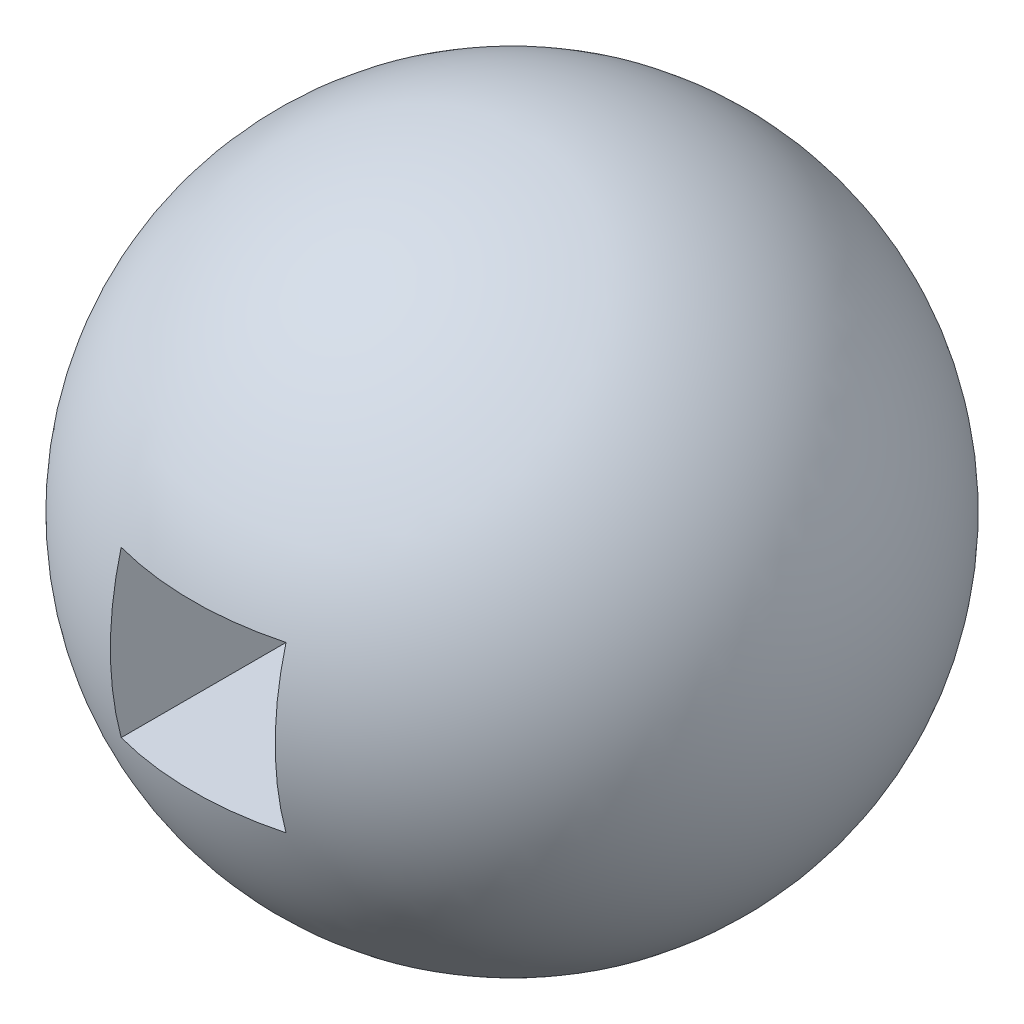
from build123d import *

# Parameters (mm, degrees)
CUT_EXTRUDE1_REACH                  = 5.464
CUT_EXTRUDE1_END_RADIUS             = 2
SKETCH2_W                           = 1
SKETCH2_H                           = 1
CUT_EXTRUDE1_DIRECTION_2_REACH      = 5.464
CUT_EXTRUDE1_DIRECTION_2_END_RADIUS = 2


with BuildPart() as part:
    # Sketch1 → Revolve1 (revolve)
    with BuildSketch(Plane.XY):
        with BuildLine():
            Line((0, 2), (0, -2))
            ThreePointArc((0, -2), (-2, 0), (0, 2))
        make_face()
    revolve(axis=Axis((0, 2, 0), (0, -1, 0)))

    # Cut-Extrude1: up to this sphere (the profile starts inside it)
    cut_extrude1_end = Location((0, 0, 0)) * Sphere(CUT_EXTRUDE1_END_RADIUS, mode=Mode.PRIVATE)
    # Sketch2 → Cut-Extrude1 (cut, up to the surface)
    with BuildSketch(Plane.XY, mode=Mode.PRIVATE) as cut_extrude1_sk1:
        Rectangle(SKETCH2_W, SKETCH2_H)
    cut_extrude1_tool1 = extrude(cut_extrude1_sk1.sketch, amount=-CUT_EXTRUDE1_REACH, mode=Mode.PRIVATE) & cut_extrude1_end
    add(cut_extrude1_tool1.solids().sort_by_distance((0, 0, 0))[0], mode=Mode.SUBTRACT)

    # Cut-Extrude1 direction 2: up to this sphere (the profile starts inside it)
    cut_extrude1_direction_2_end = Location((0, 0, 0)) * Sphere(CUT_EXTRUDE1_DIRECTION_2_END_RADIUS, mode=Mode.PRIVATE)
    # Sketch2 → Cut-Extrude1 direction 2 (cut, up to the surface)
    with BuildSketch(Plane.XY, mode=Mode.PRIVATE) as cut_extrude1_direction_2_sk1:
        Rectangle(SKETCH2_W, SKETCH2_H)
    cut_extrude1_direction_2_tool1 = extrude(cut_extrude1_direction_2_sk1.sketch, amount=CUT_EXTRUDE1_DIRECTION_2_REACH, mode=Mode.PRIVATE) & cut_extrude1_direction_2_end
    add(cut_extrude1_direction_2_tool1.solids().sort_by_distance((0, 0, 0))[0], mode=Mode.SUBTRACT)


solid = part.part
